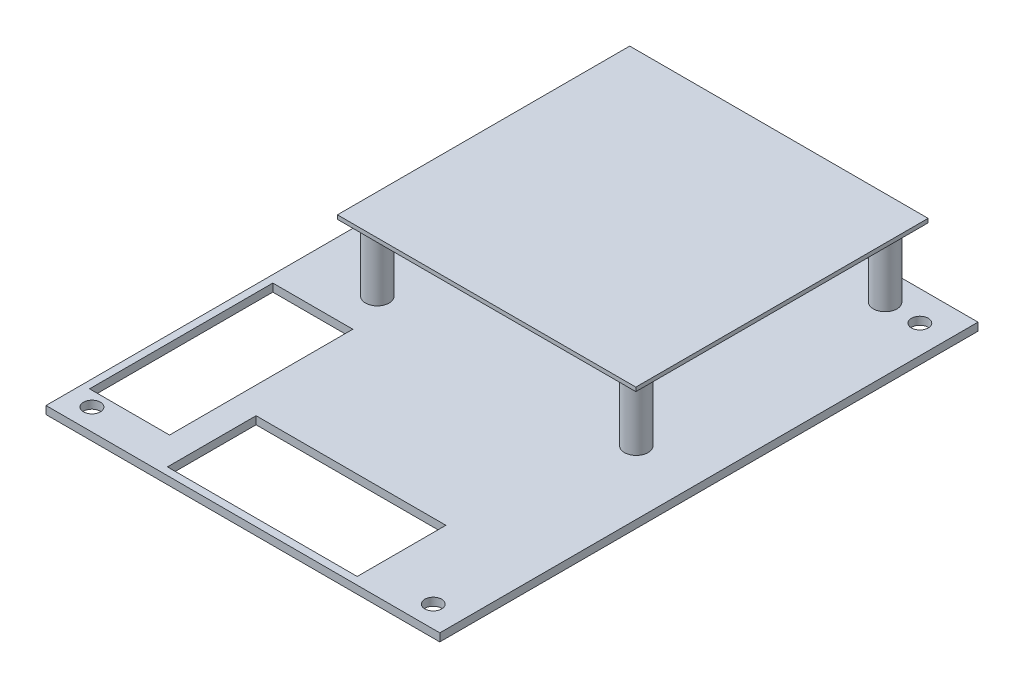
ISO-10303-21;
HEADER;
FILE_DESCRIPTION(('STEP AP214'),'2;1');
FILE_NAME('part.step','',(''),(''),'','','');
FILE_SCHEMA(('AUTOMOTIVE_DESIGN { 1 0 10303 214 1 1 1 1 }'));
ENDSEC;
DATA;
#1=APPLICATION_CONTEXT('core data for automotive mechanical design processes');
#2=APPLICATION_PROTOCOL_DEFINITION('international standard','automotive_design',2000,#1);
#3=PRODUCT_CONTEXT('',#1,'mechanical');
#4=PRODUCT('Part','Part','',(#3));
#5=PRODUCT_RELATED_PRODUCT_CATEGORY('part','',(#4));
#6=PRODUCT_DEFINITION_FORMATION('','',#4);
#7=PRODUCT_DEFINITION_CONTEXT('part definition',#1,'design');
#8=PRODUCT_DEFINITION('design','',#6,#7);
#9=PRODUCT_DEFINITION_SHAPE('','',#8);
#10=(LENGTH_UNIT() NAMED_UNIT(*) SI_UNIT(.MILLI.,.METRE.));
#11=(NAMED_UNIT(*) PLANE_ANGLE_UNIT() SI_UNIT($,.RADIAN.));
#12=(NAMED_UNIT(*) SI_UNIT($,.STERADIAN.) SOLID_ANGLE_UNIT());
#13=UNCERTAINTY_MEASURE_WITH_UNIT(LENGTH_MEASURE(1.E-05),#10,'distance_accuracy_value','');
#14=(GEOMETRIC_REPRESENTATION_CONTEXT(3) GLOBAL_UNCERTAINTY_ASSIGNED_CONTEXT((#13)) GLOBAL_UNIT_ASSIGNED_CONTEXT((#10,
#11,#12)) REPRESENTATION_CONTEXT('',''));
#15=CARTESIAN_POINT('',(0.,0.,0.));
#16=DIRECTION('',(0.,0.,1.));
#17=DIRECTION('',(1.,0.,0.));
#18=AXIS2_PLACEMENT_3D('',#15,#16,#17);
#19=CARTESIAN_POINT('',(38.1,1.524,-52.07));
#20=DIRECTION('',(-1.,0.,0.));
#21=DIRECTION('',(0.,0.,1.));
#22=AXIS2_PLACEMENT_3D('',#19,#20,#21);
#23=PLANE('',#22);
#24=DIRECTION('',(0.,0.,-1.));
#25=VECTOR('',#24,1.);
#26=CARTESIAN_POINT('',(38.1,0.,-52.07));
#27=LINE('',#26,#25);
#28=CARTESIAN_POINT('',(38.1,0.,52.07));
#29=VERTEX_POINT('',#28);
#30=CARTESIAN_POINT('',(38.1,0.,-52.07));
#31=VERTEX_POINT('',#30);
#32=EDGE_CURVE('E286',#29,#31,#27,.T.);
#33=ORIENTED_EDGE('',*,*,#32,.T.);
#34=DIRECTION('',(0.,-1.,0.));
#35=VECTOR('',#34,1.);
#36=CARTESIAN_POINT('',(38.1,1.524,-52.07));
#37=LINE('',#36,#35);
#38=CARTESIAN_POINT('',(38.1,1.524,-52.07));
#39=VERTEX_POINT('',#38);
#40=EDGE_CURVE('E11',#39,#31,#37,.T.);
#41=ORIENTED_EDGE('',*,*,#40,.F.);
#42=DIRECTION('',(0.,0.,-1.));
#43=VECTOR('',#42,1.);
#44=CARTESIAN_POINT('',(38.1,1.524,-52.07));
#45=LINE('',#44,#43);
#46=CARTESIAN_POINT('',(38.1,1.524,52.07));
#47=VERTEX_POINT('',#46);
#48=EDGE_CURVE('E287',#47,#39,#45,.T.);
#49=ORIENTED_EDGE('',*,*,#48,.F.);
#50=DIRECTION('',(0.,-1.,0.));
#51=VECTOR('',#50,1.);
#52=CARTESIAN_POINT('',(38.1,1.524,52.07));
#53=LINE('',#52,#51);
#54=EDGE_CURVE('E297',#47,#29,#53,.T.);
#55=ORIENTED_EDGE('',*,*,#54,.T.);
#56=EDGE_LOOP('',(#33,#41,#49,#55));
#57=FACE_BOUND('',#56,.T.);
#58=ADVANCED_FACE('F32',(#57),#23,.F.);
#59=CARTESIAN_POINT('',(-38.1,1.524,-52.07));
#60=DIRECTION('',(0.,0.,1.));
#61=DIRECTION('',(1.,0.,0.));
#62=AXIS2_PLACEMENT_3D('',#59,#60,#61);
#63=PLANE('',#62);
#64=DIRECTION('',(-1.,0.,0.));
#65=VECTOR('',#64,1.);
#66=CARTESIAN_POINT('',(-38.1,0.,-52.07));
#67=LINE('',#66,#65);
#68=CARTESIAN_POINT('',(-38.1,0.,-52.07));
#69=VERTEX_POINT('',#68);
#70=EDGE_CURVE('E300',#31,#69,#67,.T.);
#71=ORIENTED_EDGE('',*,*,#70,.T.);
#72=DIRECTION('',(0.,-1.,0.));
#73=VECTOR('',#72,1.);
#74=CARTESIAN_POINT('',(-38.1,1.524,-52.07));
#75=LINE('',#74,#73);
#76=CARTESIAN_POINT('',(-38.1,1.524,-52.07));
#77=VERTEX_POINT('',#76);
#78=EDGE_CURVE('E39',#77,#69,#75,.T.);
#79=ORIENTED_EDGE('',*,*,#78,.F.);
#80=DIRECTION('',(-1.,0.,0.));
#81=VECTOR('',#80,1.);
#82=CARTESIAN_POINT('',(-38.1,1.524,-52.07));
#83=LINE('',#82,#81);
#84=EDGE_CURVE('E290',#39,#77,#83,.T.);
#85=ORIENTED_EDGE('',*,*,#84,.F.);
#86=ORIENTED_EDGE('',*,*,#40,.T.);
#87=EDGE_LOOP('',(#71,#79,#85,#86));
#88=FACE_BOUND('',#87,.T.);
#89=ADVANCED_FACE('F329',(#88),#63,.F.);
#90=CARTESIAN_POINT('',(-38.1,1.524,-52.07));
#91=DIRECTION('',(1.,0.,0.));
#92=DIRECTION('',(0.,0.,-1.));
#93=AXIS2_PLACEMENT_3D('',#90,#91,#92);
#94=PLANE('',#93);
#95=DIRECTION('',(0.,0.,1.));
#96=VECTOR('',#95,1.);
#97=CARTESIAN_POINT('',(-38.1,0.,-52.07));
#98=LINE('',#97,#96);
#99=CARTESIAN_POINT('',(-38.1,0.,52.07));
#100=VERTEX_POINT('',#99);
#101=EDGE_CURVE('E302',#69,#100,#98,.T.);
#102=ORIENTED_EDGE('',*,*,#101,.T.);
#103=DIRECTION('',(0.,-1.,0.));
#104=VECTOR('',#103,1.);
#105=CARTESIAN_POINT('',(-38.1,1.524,52.07));
#106=LINE('',#105,#104);
#107=CARTESIAN_POINT('',(-38.1,1.524,52.07));
#108=VERTEX_POINT('',#107);
#109=EDGE_CURVE('E307',#108,#100,#106,.T.);
#110=ORIENTED_EDGE('',*,*,#109,.F.);
#111=DIRECTION('',(0.,0.,1.));
#112=VECTOR('',#111,1.);
#113=CARTESIAN_POINT('',(-38.1,1.524,-52.07));
#114=LINE('',#113,#112);
#115=EDGE_CURVE('E293',#77,#108,#114,.T.);
#116=ORIENTED_EDGE('',*,*,#115,.F.);
#117=ORIENTED_EDGE('',*,*,#78,.T.);
#118=EDGE_LOOP('',(#102,#110,#116,#117));
#119=FACE_BOUND('',#118,.T.);
#120=ADVANCED_FACE('F314',(#119),#94,.F.);
#121=CARTESIAN_POINT('',(-38.1,1.524,52.07));
#122=DIRECTION('',(0.,0.,-1.));
#123=DIRECTION('',(-1.,0.,0.));
#124=AXIS2_PLACEMENT_3D('',#121,#122,#123);
#125=PLANE('',#124);
#126=DIRECTION('',(1.,0.,0.));
#127=VECTOR('',#126,1.);
#128=CARTESIAN_POINT('',(-38.1,0.,52.07));
#129=LINE('',#128,#127);
#130=EDGE_CURVE('E291',#100,#29,#129,.T.);
#131=ORIENTED_EDGE('',*,*,#130,.T.);
#132=ORIENTED_EDGE('',*,*,#54,.F.);
#133=DIRECTION('',(1.,0.,0.));
#134=VECTOR('',#133,1.);
#135=CARTESIAN_POINT('',(-38.1,1.524,52.07));
#136=LINE('',#135,#134);
#137=EDGE_CURVE('E295',#108,#47,#136,.T.);
#138=ORIENTED_EDGE('',*,*,#137,.F.);
#139=ORIENTED_EDGE('',*,*,#109,.T.);
#140=EDGE_LOOP('',(#131,#132,#138,#139));
#141=FACE_BOUND('',#140,.T.);
#142=ADVANCED_FACE('F322',(#141),#125,.F.);
#143=CARTESIAN_POINT('',(0.,1.524,0.));
#144=DIRECTION('',(0.,1.,0.));
#145=DIRECTION('',(0.,0.,1.));
#146=AXIS2_PLACEMENT_3D('',#143,#144,#145);
#147=PLANE('',#146);
#148=DIRECTION('',(0.,0.,1.));
#149=VECTOR('',#148,1.);
#150=CARTESIAN_POINT('',(-16.0628621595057,1.524,0.));
#151=LINE('',#150,#149);
#152=CARTESIAN_POINT('',(-16.0628621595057,1.524,33.4570940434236));
#153=VERTEX_POINT('',#152);
#154=CARTESIAN_POINT('',(-16.0628621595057,1.524,50.6113252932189));
#155=VERTEX_POINT('',#154);
#156=EDGE_CURVE('E177',#153,#155,#151,.T.);
#157=ORIENTED_EDGE('',*,*,#156,.F.);
#158=DIRECTION('',(-1.,0.,0.));
#159=VECTOR('',#158,1.);
#160=CARTESIAN_POINT('',(0.,1.524,33.4570940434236));
#161=LINE('',#160,#159);
#162=CARTESIAN_POINT('',(20.6602311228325,1.524,33.4570940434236));
#163=VERTEX_POINT('',#162);
#164=EDGE_CURVE('E170',#163,#153,#161,.T.);
#165=ORIENTED_EDGE('',*,*,#164,.F.);
#166=DIRECTION('',(0.,0.,-1.));
#167=VECTOR('',#166,1.);
#168=CARTESIAN_POINT('',(20.6602311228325,1.524,0.));
#169=LINE('',#168,#167);
#170=CARTESIAN_POINT('',(20.6602311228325,1.524,50.6113252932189));
#171=VERTEX_POINT('',#170);
#172=EDGE_CURVE('E150',#171,#163,#169,.T.);
#173=ORIENTED_EDGE('',*,*,#172,.F.);
#174=DIRECTION('',(1.,0.,0.));
#175=VECTOR('',#174,1.);
#176=CARTESIAN_POINT('',(0.,1.524,50.6113252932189));
#177=LINE('',#176,#175);
#178=EDGE_CURVE('E175',#155,#171,#177,.T.);
#179=ORIENTED_EDGE('',*,*,#178,.F.);
#180=EDGE_LOOP('',(#157,#165,#173,#179));
#181=FACE_BOUND('',#180,.T.);
#182=DIRECTION('',(0.,0.,1.));
#183=VECTOR('',#182,1.);
#184=CARTESIAN_POINT('',(-36.6751790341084,1.524,0.));
#185=LINE('',#184,#183);
#186=CARTESIAN_POINT('',(-36.6751790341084,1.524,9.60682700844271));
#187=VERTEX_POINT('',#186);
#188=CARTESIAN_POINT('',(-36.6751790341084,1.524,45.0663299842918));
#189=VERTEX_POINT('',#188);
#190=EDGE_CURVE('E206',#187,#189,#185,.T.);
#191=ORIENTED_EDGE('',*,*,#190,.F.);
#192=DIRECTION('',(-1.,0.,0.));
#193=VECTOR('',#192,1.);
#194=CARTESIAN_POINT('',(0.,1.524,9.60682700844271));
#195=LINE('',#194,#193);
#196=CARTESIAN_POINT('',(-21.1961977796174,1.524,9.60682700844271));
#197=VERTEX_POINT('',#196);
#198=EDGE_CURVE('E193',#197,#187,#195,.T.);
#199=ORIENTED_EDGE('',*,*,#198,.F.);
#200=DIRECTION('',(0.,0.,-1.));
#201=VECTOR('',#200,1.);
#202=CARTESIAN_POINT('',(-21.1961977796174,1.524,0.));
#203=LINE('',#202,#201);
#204=CARTESIAN_POINT('',(-21.1961977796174,1.524,45.0663299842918));
#205=VERTEX_POINT('',#204);
#206=EDGE_CURVE('E201',#205,#197,#203,.T.);
#207=ORIENTED_EDGE('',*,*,#206,.F.);
#208=DIRECTION('',(1.,0.,0.));
#209=VECTOR('',#208,1.);
#210=CARTESIAN_POINT('',(0.,1.524,45.0663299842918));
#211=LINE('',#210,#209);
#212=EDGE_CURVE('E204',#189,#205,#211,.T.);
#213=ORIENTED_EDGE('',*,*,#212,.F.);
#214=EDGE_LOOP('',(#191,#199,#207,#213));
#215=FACE_BOUND('',#214,.T.);
#216=CARTESIAN_POINT('',(25.7645566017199,1.524,1.71369757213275));
#217=DIRECTION('',(0.,1.,0.));
#218=DIRECTION('',(0.,0.,1.));
#219=AXIS2_PLACEMENT_3D('',#216,#217,#218);
#220=CIRCLE('',#219,2.286);
#221=CARTESIAN_POINT('',(25.7645566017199,1.524,3.99969757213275));
#222=VERTEX_POINT('',#221);
#223=EDGE_CURVE('E238',#222,#222,#220,.T.);
#224=ORIENTED_EDGE('',*,*,#223,.F.);
#225=EDGE_LOOP('',(#224));
#226=FACE_BOUND('',#225,.T.);
#227=CARTESIAN_POINT('',(-24.3463241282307,1.524,1.71369757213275));
#228=DIRECTION('',(0.,1.,0.));
#229=DIRECTION('',(0.,0.,1.));
#230=AXIS2_PLACEMENT_3D('',#227,#228,#229);
#231=CIRCLE('',#230,2.286);
#232=CARTESIAN_POINT('',(-24.3463241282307,1.524,3.99969757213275));
#233=VERTEX_POINT('',#232);
#234=EDGE_CURVE('E242',#233,#233,#231,.T.);
#235=ORIENTED_EDGE('',*,*,#234,.F.);
#236=EDGE_LOOP('',(#235));
#237=FACE_BOUND('',#236,.T.);
#238=CARTESIAN_POINT('',(25.7645566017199,1.524,-46.4410050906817));
#239=DIRECTION('',(0.,1.,0.));
#240=DIRECTION('',(0.,0.,1.));
#241=AXIS2_PLACEMENT_3D('',#238,#239,#240);
#242=CIRCLE('',#241,2.286);
#243=CARTESIAN_POINT('',(25.7645566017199,1.524,-44.1550050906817));
#244=VERTEX_POINT('',#243);
#245=EDGE_CURVE('E248',#244,#244,#242,.T.);
#246=ORIENTED_EDGE('',*,*,#245,.F.);
#247=EDGE_LOOP('',(#246));
#248=FACE_BOUND('',#247,.T.);
#249=CARTESIAN_POINT('',(-24.3463241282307,1.524,-46.4410050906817));
#250=DIRECTION('',(0.,1.,0.));
#251=DIRECTION('',(0.,0.,1.));
#252=AXIS2_PLACEMENT_3D('',#249,#250,#251);
#253=CIRCLE('',#252,2.286);
#254=CARTESIAN_POINT('',(-24.3463241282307,1.524,-44.1550050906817));
#255=VERTEX_POINT('',#254);
#256=EDGE_CURVE('E254',#255,#255,#253,.T.);
#257=ORIENTED_EDGE('',*,*,#256,.F.);
#258=EDGE_LOOP('',(#257));
#259=FACE_BOUND('',#258,.T.);
#260=CARTESIAN_POINT('',(-33.401,1.524,-46.2788));
#261=DIRECTION('',(0.,1.,0.));
#262=DIRECTION('',(0.,0.,1.));
#263=AXIS2_PLACEMENT_3D('',#260,#261,#262);
#264=CIRCLE('',#263,1.63195);
#265=CARTESIAN_POINT('',(-33.401,1.524,-44.64685));
#266=VERTEX_POINT('',#265);
#267=EDGE_CURVE('E260',#266,#266,#264,.T.);
#268=ORIENTED_EDGE('',*,*,#267,.F.);
#269=EDGE_LOOP('',(#268));
#270=FACE_BOUND('',#269,.T.);
#271=CARTESIAN_POINT('',(32.639,1.524,-46.2788));
#272=DIRECTION('',(0.,1.,0.));
#273=DIRECTION('',(0.,0.,1.));
#274=AXIS2_PLACEMENT_3D('',#271,#272,#273);
#275=CIRCLE('',#274,1.63195);
#276=CARTESIAN_POINT('',(32.639,1.524,-44.64685));
#277=VERTEX_POINT('',#276);
#278=EDGE_CURVE('E268',#277,#277,#275,.T.);
#279=ORIENTED_EDGE('',*,*,#278,.F.);
#280=EDGE_LOOP('',(#279));
#281=FACE_BOUND('',#280,.T.);
#282=CARTESIAN_POINT('',(-33.401,1.524,47.879));
#283=DIRECTION('',(0.,1.,0.));
#284=DIRECTION('',(0.,0.,1.));
#285=AXIS2_PLACEMENT_3D('',#282,#283,#284);
#286=CIRCLE('',#285,1.63195);
#287=CARTESIAN_POINT('',(-33.401,1.524,49.51095));
#288=VERTEX_POINT('',#287);
#289=EDGE_CURVE('E274',#288,#288,#286,.T.);
#290=ORIENTED_EDGE('',*,*,#289,.F.);
#291=EDGE_LOOP('',(#290));
#292=FACE_BOUND('',#291,.T.);
#293=CARTESIAN_POINT('',(32.639,1.524,47.879));
#294=DIRECTION('',(0.,1.,0.));
#295=DIRECTION('',(0.,0.,1.));
#296=AXIS2_PLACEMENT_3D('',#293,#294,#295);
#297=CIRCLE('',#296,1.63195);
#298=CARTESIAN_POINT('',(32.639,1.524,49.51095));
#299=VERTEX_POINT('',#298);
#300=EDGE_CURVE('E280',#299,#299,#297,.T.);
#301=ORIENTED_EDGE('',*,*,#300,.F.);
#302=EDGE_LOOP('',(#301));
#303=FACE_BOUND('',#302,.T.);
#304=ORIENTED_EDGE('',*,*,#48,.T.);
#305=ORIENTED_EDGE('',*,*,#84,.T.);
#306=ORIENTED_EDGE('',*,*,#115,.T.);
#307=ORIENTED_EDGE('',*,*,#137,.T.);
#308=EDGE_LOOP('',(#304,#305,#306,#307));
#309=FACE_BOUND('',#308,.T.);
#310=ADVANCED_FACE('F328',(#181,#215,#226,#237,#248,#259,#270,#281,#292,#303,#309),#147,.T.);
#311=CARTESIAN_POINT('',(0.,0.,0.));
#312=DIRECTION('',(0.,1.,0.));
#313=DIRECTION('',(0.,0.,1.));
#314=AXIS2_PLACEMENT_3D('',#311,#312,#313);
#315=PLANE('',#314);
#316=DIRECTION('',(1.,0.,0.));
#317=VECTOR('',#316,1.);
#318=CARTESIAN_POINT('',(-16.0628621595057,0.,33.4570940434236));
#319=LINE('',#318,#317);
#320=CARTESIAN_POINT('',(-16.0628621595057,0.,33.4570940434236));
#321=VERTEX_POINT('',#320);
#322=CARTESIAN_POINT('',(20.6602311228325,0.,33.4570940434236));
#323=VERTEX_POINT('',#322);
#324=EDGE_CURVE('E156',#321,#323,#319,.T.);
#325=ORIENTED_EDGE('',*,*,#324,.F.);
#326=DIRECTION('',(0.,0.,-1.));
#327=VECTOR('',#326,1.);
#328=CARTESIAN_POINT('',(-16.0628621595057,0.,50.6113252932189));
#329=LINE('',#328,#327);
#330=CARTESIAN_POINT('',(-16.0628621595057,0.,50.6113252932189));
#331=VERTEX_POINT('',#330);
#332=EDGE_CURVE('E54',#331,#321,#329,.T.);
#333=ORIENTED_EDGE('',*,*,#332,.F.);
#334=DIRECTION('',(-1.,0.,0.));
#335=VECTOR('',#334,1.);
#336=CARTESIAN_POINT('',(-16.0628621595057,0.,50.6113252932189));
#337=LINE('',#336,#335);
#338=CARTESIAN_POINT('',(20.6602311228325,0.,50.6113252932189));
#339=VERTEX_POINT('',#338);
#340=EDGE_CURVE('E163',#339,#331,#337,.T.);
#341=ORIENTED_EDGE('',*,*,#340,.F.);
#342=DIRECTION('',(0.,0.,1.));
#343=VECTOR('',#342,1.);
#344=CARTESIAN_POINT('',(20.6602311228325,0.,50.6113252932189));
#345=LINE('',#344,#343);
#346=EDGE_CURVE('E147',#323,#339,#345,.T.);
#347=ORIENTED_EDGE('',*,*,#346,.F.);
#348=EDGE_LOOP('',(#325,#333,#341,#347));
#349=FACE_BOUND('',#348,.T.);
#350=DIRECTION('',(1.,0.,0.));
#351=VECTOR('',#350,1.);
#352=CARTESIAN_POINT('',(-36.6751790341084,0.,9.60682700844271));
#353=LINE('',#352,#351);
#354=CARTESIAN_POINT('',(-36.6751790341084,0.,9.60682700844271));
#355=VERTEX_POINT('',#354);
#356=CARTESIAN_POINT('',(-21.1961977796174,0.,9.60682700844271));
#357=VERTEX_POINT('',#356);
#358=EDGE_CURVE('E181',#355,#357,#353,.T.);
#359=ORIENTED_EDGE('',*,*,#358,.F.);
#360=DIRECTION('',(0.,0.,-1.));
#361=VECTOR('',#360,1.);
#362=CARTESIAN_POINT('',(-36.6751790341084,0.,45.0663299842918));
#363=LINE('',#362,#361);
#364=CARTESIAN_POINT('',(-36.6751790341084,0.,45.0663299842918));
#365=VERTEX_POINT('',#364);
#366=EDGE_CURVE('E179',#365,#355,#363,.T.);
#367=ORIENTED_EDGE('',*,*,#366,.F.);
#368=DIRECTION('',(-1.,0.,0.));
#369=VECTOR('',#368,1.);
#370=CARTESIAN_POINT('',(-36.6751790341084,0.,45.0663299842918));
#371=LINE('',#370,#369);
#372=CARTESIAN_POINT('',(-21.1961977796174,0.,45.0663299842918));
#373=VERTEX_POINT('',#372);
#374=EDGE_CURVE('E187',#373,#365,#371,.T.);
#375=ORIENTED_EDGE('',*,*,#374,.F.);
#376=DIRECTION('',(0.,0.,1.));
#377=VECTOR('',#376,1.);
#378=CARTESIAN_POINT('',(-21.1961977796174,0.,45.0663299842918));
#379=LINE('',#378,#377);
#380=EDGE_CURVE('E184',#357,#373,#379,.T.);
#381=ORIENTED_EDGE('',*,*,#380,.F.);
#382=EDGE_LOOP('',(#359,#367,#375,#381));
#383=FACE_BOUND('',#382,.T.);
#384=CARTESIAN_POINT('',(-33.401,0.,-46.2788));
#385=DIRECTION('',(0.,1.,0.));
#386=DIRECTION('',(0.,0.,1.));
#387=AXIS2_PLACEMENT_3D('',#384,#385,#386);
#388=CIRCLE('',#387,1.63195);
#389=CARTESIAN_POINT('',(-33.401,0.,-44.64685));
#390=VERTEX_POINT('',#389);
#391=EDGE_CURVE('E265',#390,#390,#388,.T.);
#392=ORIENTED_EDGE('',*,*,#391,.T.);
#393=EDGE_LOOP('',(#392));
#394=FACE_BOUND('',#393,.T.);
#395=CARTESIAN_POINT('',(32.639,0.,-46.2788));
#396=DIRECTION('',(0.,1.,0.));
#397=DIRECTION('',(0.,0.,1.));
#398=AXIS2_PLACEMENT_3D('',#395,#396,#397);
#399=CIRCLE('',#398,1.63195);
#400=CARTESIAN_POINT('',(32.639,0.,-44.64685));
#401=VERTEX_POINT('',#400);
#402=EDGE_CURVE('E271',#401,#401,#399,.T.);
#403=ORIENTED_EDGE('',*,*,#402,.T.);
#404=EDGE_LOOP('',(#403));
#405=FACE_BOUND('',#404,.T.);
#406=CARTESIAN_POINT('',(-33.401,0.,47.879));
#407=DIRECTION('',(0.,1.,0.));
#408=DIRECTION('',(0.,0.,1.));
#409=AXIS2_PLACEMENT_3D('',#406,#407,#408);
#410=CIRCLE('',#409,1.63195);
#411=CARTESIAN_POINT('',(-33.401,0.,49.51095));
#412=VERTEX_POINT('',#411);
#413=EDGE_CURVE('E277',#412,#412,#410,.T.);
#414=ORIENTED_EDGE('',*,*,#413,.T.);
#415=EDGE_LOOP('',(#414));
#416=FACE_BOUND('',#415,.T.);
#417=CARTESIAN_POINT('',(32.639,0.,47.879));
#418=DIRECTION('',(0.,1.,0.));
#419=DIRECTION('',(0.,0.,1.));
#420=AXIS2_PLACEMENT_3D('',#417,#418,#419);
#421=CIRCLE('',#420,1.63195);
#422=CARTESIAN_POINT('',(32.639,0.,49.51095));
#423=VERTEX_POINT('',#422);
#424=EDGE_CURVE('E283',#423,#423,#421,.T.);
#425=ORIENTED_EDGE('',*,*,#424,.T.);
#426=EDGE_LOOP('',(#425));
#427=FACE_BOUND('',#426,.T.);
#428=ORIENTED_EDGE('',*,*,#32,.F.);
#429=ORIENTED_EDGE('',*,*,#130,.F.);
#430=ORIENTED_EDGE('',*,*,#101,.F.);
#431=ORIENTED_EDGE('',*,*,#70,.F.);
#432=EDGE_LOOP('',(#428,#429,#430,#431));
#433=FACE_BOUND('',#432,.T.);
#434=ADVANCED_FACE('F160',(#349,#383,#394,#405,#416,#427,#433),#315,.F.);
#435=CARTESIAN_POINT('',(32.639,1.524,47.879));
#436=DIRECTION('',(0.,1.,0.));
#437=DIRECTION('',(0.,0.,1.));
#438=AXIS2_PLACEMENT_3D('',#435,#436,#437);
#439=CYLINDRICAL_SURFACE('',#438,1.63195);
#440=ORIENTED_EDGE('',*,*,#424,.F.);
#441=EDGE_LOOP('',(#440));
#442=FACE_BOUND('',#441,.T.);
#443=ORIENTED_EDGE('',*,*,#300,.T.);
#444=EDGE_LOOP('',(#443));
#445=FACE_BOUND('',#444,.T.);
#446=ADVANCED_FACE('F341',(#442,#445),#439,.F.);
#447=CARTESIAN_POINT('',(-33.401,1.524,47.879));
#448=DIRECTION('',(0.,1.,0.));
#449=DIRECTION('',(0.,0.,1.));
#450=AXIS2_PLACEMENT_3D('',#447,#448,#449);
#451=CYLINDRICAL_SURFACE('',#450,1.63195);
#452=ORIENTED_EDGE('',*,*,#413,.F.);
#453=EDGE_LOOP('',(#452));
#454=FACE_BOUND('',#453,.T.);
#455=ORIENTED_EDGE('',*,*,#289,.T.);
#456=EDGE_LOOP('',(#455));
#457=FACE_BOUND('',#456,.T.);
#458=ADVANCED_FACE('F347',(#454,#457),#451,.F.);
#459=CARTESIAN_POINT('',(32.639,1.524,-46.2788));
#460=DIRECTION('',(0.,1.,0.));
#461=DIRECTION('',(0.,0.,1.));
#462=AXIS2_PLACEMENT_3D('',#459,#460,#461);
#463=CYLINDRICAL_SURFACE('',#462,1.63195);
#464=ORIENTED_EDGE('',*,*,#402,.F.);
#465=EDGE_LOOP('',(#464));
#466=FACE_BOUND('',#465,.T.);
#467=ORIENTED_EDGE('',*,*,#278,.T.);
#468=EDGE_LOOP('',(#467));
#469=FACE_BOUND('',#468,.T.);
#470=ADVANCED_FACE('F351',(#466,#469),#463,.F.);
#471=CARTESIAN_POINT('',(-33.401,1.524,-46.2788));
#472=DIRECTION('',(0.,1.,0.));
#473=DIRECTION('',(0.,0.,1.));
#474=AXIS2_PLACEMENT_3D('',#471,#472,#473);
#475=CYLINDRICAL_SURFACE('',#474,1.63195);
#476=ORIENTED_EDGE('',*,*,#391,.F.);
#477=EDGE_LOOP('',(#476));
#478=FACE_BOUND('',#477,.T.);
#479=ORIENTED_EDGE('',*,*,#267,.T.);
#480=EDGE_LOOP('',(#479));
#481=FACE_BOUND('',#480,.T.);
#482=ADVANCED_FACE('F355',(#478,#481),#475,.F.);
#483=CARTESIAN_POINT('',(-24.3463241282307,14.224,-46.4410050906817));
#484=DIRECTION('',(0.,-1.,0.));
#485=DIRECTION('',(0.,0.,-1.));
#486=AXIS2_PLACEMENT_3D('',#483,#484,#485);
#487=CYLINDRICAL_SURFACE('',#486,2.286);
#488=CARTESIAN_POINT('',(-24.3463241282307,14.224,-46.4410050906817));
#489=DIRECTION('',(0.,1.,0.));
#490=DIRECTION('',(0.,0.,1.));
#491=AXIS2_PLACEMENT_3D('',#488,#489,#490);
#492=CIRCLE('',#491,2.286);
#493=CARTESIAN_POINT('',(-24.3463241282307,14.224,-44.1550050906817));
#494=VERTEX_POINT('',#493);
#495=EDGE_CURVE('E257',#494,#494,#492,.T.);
#496=ORIENTED_EDGE('',*,*,#495,.F.);
#497=EDGE_LOOP('',(#496));
#498=FACE_BOUND('',#497,.T.);
#499=ORIENTED_EDGE('',*,*,#256,.T.);
#500=EDGE_LOOP('',(#499));
#501=FACE_BOUND('',#500,.T.);
#502=ADVANCED_FACE('F359',(#498,#501),#487,.T.);
#503=CARTESIAN_POINT('',(25.7645566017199,14.224,-46.4410050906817));
#504=DIRECTION('',(0.,-1.,0.));
#505=DIRECTION('',(0.,0.,-1.));
#506=AXIS2_PLACEMENT_3D('',#503,#504,#505);
#507=CYLINDRICAL_SURFACE('',#506,2.286);
#508=CARTESIAN_POINT('',(25.7645566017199,14.224,-46.4410050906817));
#509=DIRECTION('',(0.,1.,0.));
#510=DIRECTION('',(0.,0.,1.));
#511=AXIS2_PLACEMENT_3D('',#508,#509,#510);
#512=CIRCLE('',#511,2.286);
#513=CARTESIAN_POINT('',(25.7645566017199,14.224,-44.1550050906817));
#514=VERTEX_POINT('',#513);
#515=EDGE_CURVE('E251',#514,#514,#512,.T.);
#516=ORIENTED_EDGE('',*,*,#515,.F.);
#517=EDGE_LOOP('',(#516));
#518=FACE_BOUND('',#517,.T.);
#519=ORIENTED_EDGE('',*,*,#245,.T.);
#520=EDGE_LOOP('',(#519));
#521=FACE_BOUND('',#520,.T.);
#522=ADVANCED_FACE('F363',(#518,#521),#507,.T.);
#523=CARTESIAN_POINT('',(-24.3463241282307,14.224,1.71369757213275));
#524=DIRECTION('',(0.,-1.,0.));
#525=DIRECTION('',(0.,0.,-1.));
#526=AXIS2_PLACEMENT_3D('',#523,#524,#525);
#527=CYLINDRICAL_SURFACE('',#526,2.286);
#528=CARTESIAN_POINT('',(-24.3463241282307,14.224,1.71369757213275));
#529=DIRECTION('',(0.,1.,0.));
#530=DIRECTION('',(0.,0.,1.));
#531=AXIS2_PLACEMENT_3D('',#528,#529,#530);
#532=CIRCLE('',#531,2.286);
#533=CARTESIAN_POINT('',(-24.3463241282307,14.224,3.99969757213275));
#534=VERTEX_POINT('',#533);
#535=EDGE_CURVE('E245',#534,#534,#532,.T.);
#536=ORIENTED_EDGE('',*,*,#535,.F.);
#537=EDGE_LOOP('',(#536));
#538=FACE_BOUND('',#537,.T.);
#539=ORIENTED_EDGE('',*,*,#234,.T.);
#540=EDGE_LOOP('',(#539));
#541=FACE_BOUND('',#540,.T.);
#542=ADVANCED_FACE('F367',(#538,#541),#527,.T.);
#543=CARTESIAN_POINT('',(25.7645566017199,14.224,1.71369757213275));
#544=DIRECTION('',(0.,-1.,0.));
#545=DIRECTION('',(0.,0.,-1.));
#546=AXIS2_PLACEMENT_3D('',#543,#544,#545);
#547=CYLINDRICAL_SURFACE('',#546,2.286);
#548=CARTESIAN_POINT('',(25.7645566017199,14.224,1.71369757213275));
#549=DIRECTION('',(0.,1.,0.));
#550=DIRECTION('',(0.,0.,1.));
#551=AXIS2_PLACEMENT_3D('',#548,#549,#550);
#552=CIRCLE('',#551,2.286);
#553=CARTESIAN_POINT('',(25.7645566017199,14.224,3.99969757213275));
#554=VERTEX_POINT('',#553);
#555=EDGE_CURVE('E239',#554,#554,#552,.T.);
#556=ORIENTED_EDGE('',*,*,#555,.F.);
#557=EDGE_LOOP('',(#556));
#558=FACE_BOUND('',#557,.T.);
#559=ORIENTED_EDGE('',*,*,#223,.T.);
#560=EDGE_LOOP('',(#559));
#561=FACE_BOUND('',#560,.T.);
#562=ADVANCED_FACE('F371',(#558,#561),#547,.T.);
#563=CARTESIAN_POINT('',(-28.3970476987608,14.986,5.3836069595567));
#564=DIRECTION('',(1.,0.,0.));
#565=DIRECTION('',(0.,0.,-1.));
#566=AXIS2_PLACEMENT_3D('',#563,#564,#565);
#567=PLANE('',#566);
#568=DIRECTION('',(0.,0.,1.));
#569=VECTOR('',#568,1.);
#570=CARTESIAN_POINT('',(-28.3970476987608,14.224,5.3836069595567));
#571=LINE('',#570,#569);
#572=CARTESIAN_POINT('',(-28.3970476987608,14.224,-51.1738463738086));
#573=VERTEX_POINT('',#572);
#574=CARTESIAN_POINT('',(-28.3970476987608,14.224,5.3836069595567));
#575=VERTEX_POINT('',#574);
#576=EDGE_CURVE('E208',#573,#575,#571,.T.);
#577=ORIENTED_EDGE('',*,*,#576,.T.);
#578=DIRECTION('',(0.,-1.,0.));
#579=VECTOR('',#578,1.);
#580=CARTESIAN_POINT('',(-28.3970476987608,14.986,5.3836069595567));
#581=LINE('',#580,#579);
#582=CARTESIAN_POINT('',(-28.3970476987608,14.986,5.3836069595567));
#583=VERTEX_POINT('',#582);
#584=EDGE_CURVE('E235',#583,#575,#581,.T.);
#585=ORIENTED_EDGE('',*,*,#584,.F.);
#586=DIRECTION('',(0.,0.,1.));
#587=VECTOR('',#586,1.);
#588=CARTESIAN_POINT('',(-28.3970476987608,14.986,5.3836069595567));
#589=LINE('',#588,#587);
#590=CARTESIAN_POINT('',(-28.3970476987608,14.986,-51.1738463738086));
#591=VERTEX_POINT('',#590);
#592=EDGE_CURVE('E209',#591,#583,#589,.T.);
#593=ORIENTED_EDGE('',*,*,#592,.F.);
#594=DIRECTION('',(0.,-1.,0.));
#595=VECTOR('',#594,1.);
#596=CARTESIAN_POINT('',(-28.3970476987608,14.986,-51.1738463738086));
#597=LINE('',#596,#595);
#598=EDGE_CURVE('E219',#591,#573,#597,.T.);
#599=ORIENTED_EDGE('',*,*,#598,.T.);
#600=EDGE_LOOP('',(#577,#585,#593,#599));
#601=FACE_BOUND('',#600,.T.);
#602=ADVANCED_FACE('F375',(#601),#567,.F.);
#603=CARTESIAN_POINT('',(-28.3970476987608,14.986,5.3836069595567));
#604=DIRECTION('',(0.,0.,-1.));
#605=DIRECTION('',(-1.,0.,0.));
#606=AXIS2_PLACEMENT_3D('',#603,#604,#605);
#607=PLANE('',#606);
#608=DIRECTION('',(1.,0.,0.));
#609=VECTOR('',#608,1.);
#610=CARTESIAN_POINT('',(-28.3970476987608,14.224,5.3836069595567));
#611=LINE('',#610,#609);
#612=CARTESIAN_POINT('',(29.3436159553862,14.224,5.3836069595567));
#613=VERTEX_POINT('',#612);
#614=EDGE_CURVE('E222',#575,#613,#611,.T.);
#615=ORIENTED_EDGE('',*,*,#614,.T.);
#616=DIRECTION('',(0.,-1.,0.));
#617=VECTOR('',#616,1.);
#618=CARTESIAN_POINT('',(29.3436159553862,14.986,5.3836069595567));
#619=LINE('',#618,#617);
#620=CARTESIAN_POINT('',(29.3436159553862,14.986,5.3836069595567));
#621=VERTEX_POINT('',#620);
#622=EDGE_CURVE('E232',#621,#613,#619,.T.);
#623=ORIENTED_EDGE('',*,*,#622,.F.);
#624=DIRECTION('',(1.,0.,0.));
#625=VECTOR('',#624,1.);
#626=CARTESIAN_POINT('',(-28.3970476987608,14.986,5.3836069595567));
#627=LINE('',#626,#625);
#628=EDGE_CURVE('E212',#583,#621,#627,.T.);
#629=ORIENTED_EDGE('',*,*,#628,.F.);
#630=ORIENTED_EDGE('',*,*,#584,.T.);
#631=EDGE_LOOP('',(#615,#623,#629,#630));
#632=FACE_BOUND('',#631,.T.);
#633=ADVANCED_FACE('F379',(#632),#607,.F.);
#634=CARTESIAN_POINT('',(29.3436159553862,14.986,5.3836069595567));
#635=DIRECTION('',(-1.,0.,0.));
#636=DIRECTION('',(0.,0.,1.));
#637=AXIS2_PLACEMENT_3D('',#634,#635,#636);
#638=PLANE('',#637);
#639=DIRECTION('',(0.,0.,-1.));
#640=VECTOR('',#639,1.);
#641=CARTESIAN_POINT('',(29.3436159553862,14.224,5.3836069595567));
#642=LINE('',#641,#640);
#643=CARTESIAN_POINT('',(29.3436159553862,14.224,-51.1738463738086));
#644=VERTEX_POINT('',#643);
#645=EDGE_CURVE('E224',#613,#644,#642,.T.);
#646=ORIENTED_EDGE('',*,*,#645,.T.);
#647=DIRECTION('',(0.,-1.,0.));
#648=VECTOR('',#647,1.);
#649=CARTESIAN_POINT('',(29.3436159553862,14.986,-51.1738463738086));
#650=LINE('',#649,#648);
#651=CARTESIAN_POINT('',(29.3436159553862,14.986,-51.1738463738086));
#652=VERTEX_POINT('',#651);
#653=EDGE_CURVE('E229',#652,#644,#650,.T.);
#654=ORIENTED_EDGE('',*,*,#653,.F.);
#655=DIRECTION('',(0.,0.,-1.));
#656=VECTOR('',#655,1.);
#657=CARTESIAN_POINT('',(29.3436159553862,14.986,5.3836069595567));
#658=LINE('',#657,#656);
#659=EDGE_CURVE('E215',#621,#652,#658,.T.);
#660=ORIENTED_EDGE('',*,*,#659,.F.);
#661=ORIENTED_EDGE('',*,*,#622,.T.);
#662=EDGE_LOOP('',(#646,#654,#660,#661));
#663=FACE_BOUND('',#662,.T.);
#664=ADVANCED_FACE('F383',(#663),#638,.F.);
#665=CARTESIAN_POINT('',(-28.3970476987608,14.986,-51.1738463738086));
#666=DIRECTION('',(0.,0.,1.));
#667=DIRECTION('',(1.,0.,0.));
#668=AXIS2_PLACEMENT_3D('',#665,#666,#667);
#669=PLANE('',#668);
#670=DIRECTION('',(-1.,0.,0.));
#671=VECTOR('',#670,1.);
#672=CARTESIAN_POINT('',(-28.3970476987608,14.224,-51.1738463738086));
#673=LINE('',#672,#671);
#674=EDGE_CURVE('E213',#644,#573,#673,.T.);
#675=ORIENTED_EDGE('',*,*,#674,.T.);
#676=ORIENTED_EDGE('',*,*,#598,.F.);
#677=DIRECTION('',(-1.,0.,0.));
#678=VECTOR('',#677,1.);
#679=CARTESIAN_POINT('',(-28.3970476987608,14.986,-51.1738463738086));
#680=LINE('',#679,#678);
#681=EDGE_CURVE('E217',#652,#591,#680,.T.);
#682=ORIENTED_EDGE('',*,*,#681,.F.);
#683=ORIENTED_EDGE('',*,*,#653,.T.);
#684=EDGE_LOOP('',(#675,#676,#682,#683));
#685=FACE_BOUND('',#684,.T.);
#686=ADVANCED_FACE('F387',(#685),#669,.F.);
#687=CARTESIAN_POINT('',(0.,14.986,0.));
#688=DIRECTION('',(0.,-1.,0.));
#689=DIRECTION('',(0.,0.,-1.));
#690=AXIS2_PLACEMENT_3D('',#687,#688,#689);
#691=PLANE('',#690);
#692=ORIENTED_EDGE('',*,*,#592,.T.);
#693=ORIENTED_EDGE('',*,*,#628,.T.);
#694=ORIENTED_EDGE('',*,*,#659,.T.);
#695=ORIENTED_EDGE('',*,*,#681,.T.);
#696=EDGE_LOOP('',(#692,#693,#694,#695));
#697=FACE_BOUND('',#696,.T.);
#698=ADVANCED_FACE('F391',(#697),#691,.F.);
#699=CARTESIAN_POINT('',(0.,14.224,0.));
#700=DIRECTION('',(0.,-1.,0.));
#701=DIRECTION('',(0.,0.,-1.));
#702=AXIS2_PLACEMENT_3D('',#699,#700,#701);
#703=PLANE('',#702);
#704=ORIENTED_EDGE('',*,*,#495,.T.);
#705=EDGE_LOOP('',(#704));
#706=FACE_BOUND('',#705,.T.);
#707=ORIENTED_EDGE('',*,*,#515,.T.);
#708=EDGE_LOOP('',(#707));
#709=FACE_BOUND('',#708,.T.);
#710=ORIENTED_EDGE('',*,*,#535,.T.);
#711=EDGE_LOOP('',(#710));
#712=FACE_BOUND('',#711,.T.);
#713=ORIENTED_EDGE('',*,*,#555,.T.);
#714=EDGE_LOOP('',(#713));
#715=FACE_BOUND('',#714,.T.);
#716=ORIENTED_EDGE('',*,*,#576,.F.);
#717=ORIENTED_EDGE('',*,*,#674,.F.);
#718=ORIENTED_EDGE('',*,*,#645,.F.);
#719=ORIENTED_EDGE('',*,*,#614,.F.);
#720=EDGE_LOOP('',(#716,#717,#718,#719));
#721=FACE_BOUND('',#720,.T.);
#722=ADVANCED_FACE('F393',(#706,#709,#712,#715,#721),#703,.T.);
#723=CARTESIAN_POINT('',(-36.6751790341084,14.986,45.0663299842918));
#724=DIRECTION('',(-1.,0.,0.));
#725=DIRECTION('',(0.,0.,1.));
#726=AXIS2_PLACEMENT_3D('',#723,#724,#725);
#727=PLANE('',#726);
#728=ORIENTED_EDGE('',*,*,#190,.T.);
#729=DIRECTION('',(0.,-1.,0.));
#730=VECTOR('',#729,1.);
#731=CARTESIAN_POINT('',(-36.6751790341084,14.986,45.0663299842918));
#732=LINE('',#731,#730);
#733=EDGE_CURVE('E191',#189,#365,#732,.T.);
#734=ORIENTED_EDGE('',*,*,#733,.T.);
#735=ORIENTED_EDGE('',*,*,#366,.T.);
#736=DIRECTION('',(0.,-1.,0.));
#737=VECTOR('',#736,1.);
#738=CARTESIAN_POINT('',(-36.6751790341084,14.986,9.60682700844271));
#739=LINE('',#738,#737);
#740=EDGE_CURVE('E190',#187,#355,#739,.T.);
#741=ORIENTED_EDGE('',*,*,#740,.F.);
#742=EDGE_LOOP('',(#728,#734,#735,#741));
#743=FACE_BOUND('',#742,.T.);
#744=ADVANCED_FACE('F396',(#743),#727,.F.);
#745=CARTESIAN_POINT('',(-36.6751790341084,14.986,45.0663299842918));
#746=DIRECTION('',(0.,0.,1.));
#747=DIRECTION('',(1.,0.,0.));
#748=AXIS2_PLACEMENT_3D('',#745,#746,#747);
#749=PLANE('',#748);
#750=ORIENTED_EDGE('',*,*,#212,.T.);
#751=DIRECTION('',(0.,-1.,0.));
#752=VECTOR('',#751,1.);
#753=CARTESIAN_POINT('',(-21.1961977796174,14.986,45.0663299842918));
#754=LINE('',#753,#752);
#755=EDGE_CURVE('E194',#205,#373,#754,.T.);
#756=ORIENTED_EDGE('',*,*,#755,.T.);
#757=ORIENTED_EDGE('',*,*,#374,.T.);
#758=ORIENTED_EDGE('',*,*,#733,.F.);
#759=EDGE_LOOP('',(#750,#756,#757,#758));
#760=FACE_BOUND('',#759,.T.);
#761=ADVANCED_FACE('F403',(#760),#749,.F.);
#762=CARTESIAN_POINT('',(-21.1961977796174,14.986,45.0663299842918));
#763=DIRECTION('',(1.,0.,0.));
#764=DIRECTION('',(0.,0.,-1.));
#765=AXIS2_PLACEMENT_3D('',#762,#763,#764);
#766=PLANE('',#765);
#767=ORIENTED_EDGE('',*,*,#206,.T.);
#768=DIRECTION('',(0.,-1.,0.));
#769=VECTOR('',#768,1.);
#770=CARTESIAN_POINT('',(-21.1961977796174,14.986,9.60682700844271));
#771=LINE('',#770,#769);
#772=EDGE_CURVE('E196',#197,#357,#771,.T.);
#773=ORIENTED_EDGE('',*,*,#772,.T.);
#774=ORIENTED_EDGE('',*,*,#380,.T.);
#775=ORIENTED_EDGE('',*,*,#755,.F.);
#776=EDGE_LOOP('',(#767,#773,#774,#775));
#777=FACE_BOUND('',#776,.T.);
#778=ADVANCED_FACE('F409',(#777),#766,.F.);
#779=CARTESIAN_POINT('',(-36.6751790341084,14.986,9.60682700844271));
#780=DIRECTION('',(0.,0.,-1.));
#781=DIRECTION('',(-1.,0.,0.));
#782=AXIS2_PLACEMENT_3D('',#779,#780,#781);
#783=PLANE('',#782);
#784=ORIENTED_EDGE('',*,*,#198,.T.);
#785=ORIENTED_EDGE('',*,*,#740,.T.);
#786=ORIENTED_EDGE('',*,*,#358,.T.);
#787=ORIENTED_EDGE('',*,*,#772,.F.);
#788=EDGE_LOOP('',(#784,#785,#786,#787));
#789=FACE_BOUND('',#788,.T.);
#790=ADVANCED_FACE('F405',(#789),#783,.F.);
#791=CARTESIAN_POINT('',(-16.0628621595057,14.986,50.6113252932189));
#792=DIRECTION('',(-1.,0.,0.));
#793=DIRECTION('',(0.,0.,1.));
#794=AXIS2_PLACEMENT_3D('',#791,#792,#793);
#795=PLANE('',#794);
#796=ORIENTED_EDGE('',*,*,#156,.T.);
#797=DIRECTION('',(0.,-1.,0.));
#798=VECTOR('',#797,1.);
#799=CARTESIAN_POINT('',(-16.0628621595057,14.986,50.6113252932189));
#800=LINE('',#799,#798);
#801=EDGE_CURVE('E168',#155,#331,#800,.T.);
#802=ORIENTED_EDGE('',*,*,#801,.T.);
#803=ORIENTED_EDGE('',*,*,#332,.T.);
#804=DIRECTION('',(0.,-1.,0.));
#805=VECTOR('',#804,1.);
#806=CARTESIAN_POINT('',(-16.0628621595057,14.986,33.4570940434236));
#807=LINE('',#806,#805);
#808=EDGE_CURVE('E153',#153,#321,#807,.T.);
#809=ORIENTED_EDGE('',*,*,#808,.F.);
#810=EDGE_LOOP('',(#796,#802,#803,#809));
#811=FACE_BOUND('',#810,.T.);
#812=ADVANCED_FACE('F408',(#811),#795,.F.);
#813=CARTESIAN_POINT('',(-16.0628621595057,14.986,50.6113252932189));
#814=DIRECTION('',(0.,0.,1.));
#815=DIRECTION('',(1.,0.,0.));
#816=AXIS2_PLACEMENT_3D('',#813,#814,#815);
#817=PLANE('',#816);
#818=ORIENTED_EDGE('',*,*,#178,.T.);
#819=DIRECTION('',(0.,-1.,0.));
#820=VECTOR('',#819,1.);
#821=CARTESIAN_POINT('',(20.6602311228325,14.986,50.6113252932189));
#822=LINE('',#821,#820);
#823=EDGE_CURVE('E152',#171,#339,#822,.T.);
#824=ORIENTED_EDGE('',*,*,#823,.T.);
#825=ORIENTED_EDGE('',*,*,#340,.T.);
#826=ORIENTED_EDGE('',*,*,#801,.F.);
#827=EDGE_LOOP('',(#818,#824,#825,#826));
#828=FACE_BOUND('',#827,.T.);
#829=ADVANCED_FACE('F419',(#828),#817,.F.);
#830=CARTESIAN_POINT('',(20.6602311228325,14.986,50.6113252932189));
#831=DIRECTION('',(1.,0.,0.));
#832=DIRECTION('',(0.,0.,-1.));
#833=AXIS2_PLACEMENT_3D('',#830,#831,#832);
#834=PLANE('',#833);
#835=ORIENTED_EDGE('',*,*,#172,.T.);
#836=DIRECTION('',(0.,-1.,0.));
#837=VECTOR('',#836,1.);
#838=CARTESIAN_POINT('',(20.6602311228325,14.986,33.4570940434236));
#839=LINE('',#838,#837);
#840=EDGE_CURVE('E46',#163,#323,#839,.T.);
#841=ORIENTED_EDGE('',*,*,#840,.T.);
#842=ORIENTED_EDGE('',*,*,#346,.T.);
#843=ORIENTED_EDGE('',*,*,#823,.F.);
#844=EDGE_LOOP('',(#835,#841,#842,#843));
#845=FACE_BOUND('',#844,.T.);
#846=ADVANCED_FACE('F144',(#845),#834,.F.);
#847=CARTESIAN_POINT('',(-16.0628621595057,14.986,33.4570940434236));
#848=DIRECTION('',(0.,0.,-1.));
#849=DIRECTION('',(-1.,0.,0.));
#850=AXIS2_PLACEMENT_3D('',#847,#848,#849);
#851=PLANE('',#850);
#852=ORIENTED_EDGE('',*,*,#164,.T.);
#853=ORIENTED_EDGE('',*,*,#808,.T.);
#854=ORIENTED_EDGE('',*,*,#324,.T.);
#855=ORIENTED_EDGE('',*,*,#840,.F.);
#856=EDGE_LOOP('',(#852,#853,#854,#855));
#857=FACE_BOUND('',#856,.T.);
#858=ADVANCED_FACE('F157',(#857),#851,.F.);
#859=CLOSED_SHELL('',(#58,#89,#120,#142,#310,#434,#446,#458,#470,#482,#502,#522,#542,#562,#602,
#633,#664,#686,#698,#722,#744,#761,#778,#790,#812,#829,#846,#858));
#860=MANIFOLD_SOLID_BREP('B2',#859);
#861=ADVANCED_BREP_SHAPE_REPRESENTATION('',(#18,#860),#14);
#862=SHAPE_DEFINITION_REPRESENTATION(#9,#861);
ENDSEC;
END-ISO-10303-21;
